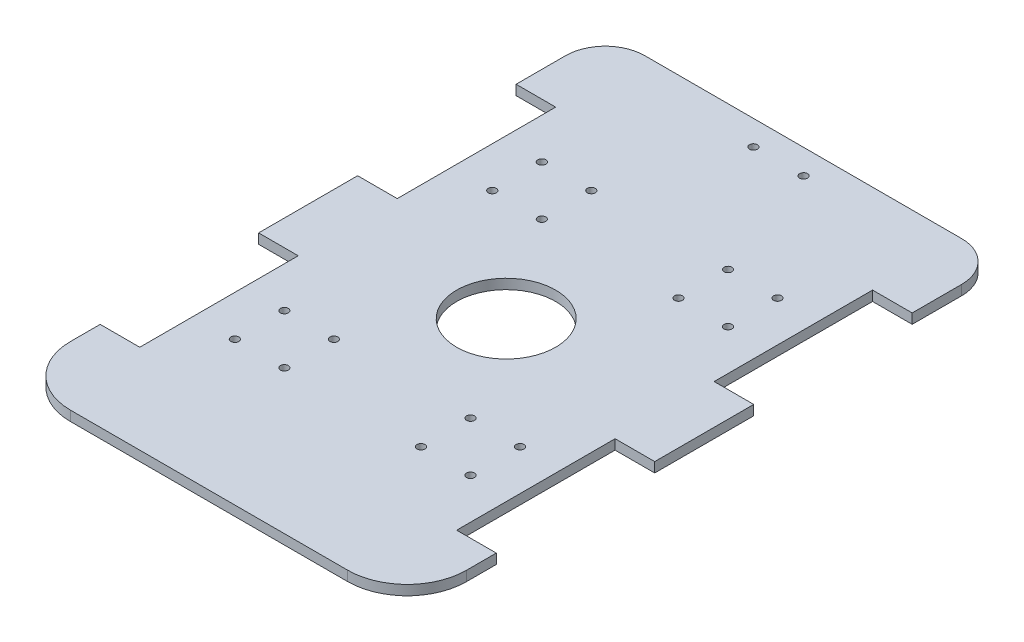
from build123d import *

# Parameters (mm, degrees)
SKETCH1_R           = 25
SKETCH1_R_2         = 2
BOSS_EXTRUDE1_DEPTH = 5


with BuildPart() as part:
    # Sketch1 → Boss-Extrude1 (new body)
    with BuildSketch(Plane(origin=(0, 0, 0), x_dir=(1, 0, 0), z_dir=(0, 1, 0))):
        with BuildLine():
            Line((-80, 150), (80, 150))
            ThreePointArc((80, 150), (94.142135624, 144.142135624), (100, 130))
            Line((100, 130), (100, 105))
            Line((100, 105), (80, 105))
            Line((80, 105), (80, 25))
            Line((80, 25), (100, 25))
            Line((100, 25), (100, -25))
            Line((100, -25), (80, -25))
            Line((80, -25), (80, -105))
            Line((80, -105), (100, -105))
            Line((100, -105), (100, -120))
            ThreePointArc((100, -120), (91.213203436, -141.213203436), (70, -150))
            Line((70, -150), (-70, -150))
            ThreePointArc((-70, -150), (-91.213203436, -141.213203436), (-100, -120))
            Line((-100, -120), (-100, -105))
            Line((-100, -105), (-80, -105))
            Line((-80, -105), (-80, -25))
            Line((-80, -25), (-100, -25))
            Line((-100, -25), (-100, 25))
            Line((-100, 25), (-80, 25))
            Line((-80, 25), (-80, 105))
            Line((-80, 105), (-100, 105))
            Line((-100, 105), (-100, 130))
            ThreePointArc((-100, 130), (-94.142135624, 144.142135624), (-80, 150))
        make_face()
        with Locations(Location((0, 0, 0), (0, 0, 270))):
            Circle(SKETCH1_R, mode=Mode.SUBTRACT)
        with Locations(Location((-34.5, 52.5, 0), (0, 0, 270))):
            Circle(SKETCH1_R_2, mode=Mode.SUBTRACT)
        with Locations(Location((-59.5, 52.5, 0), (0, 0, 270))):
            Circle(SKETCH1_R_2, mode=Mode.SUBTRACT)
        with Locations(Location((-59.5, 77.5, 0), (0, 0, 270))):
            Circle(SKETCH1_R_2, mode=Mode.SUBTRACT)
        with Locations(Location((-34.5, 77.5, 0), (0, 0, 270))):
            Circle(SKETCH1_R_2, mode=Mode.SUBTRACT)
        with Locations(Location((-59.5, -77.5, 0), (0, 0, 90))):
            Circle(SKETCH1_R_2, mode=Mode.SUBTRACT)
        with Locations(Location((-59.5, -52.5, 0), (0, 0, 90))):
            Circle(SKETCH1_R_2, mode=Mode.SUBTRACT)
        with Locations(Location((-34.5, -52.5, 0), (0, 0, 90))):
            Circle(SKETCH1_R_2, mode=Mode.SUBTRACT)
        with Locations(Location((-34.5, -77.5, 0), (0, 0, 90))):
            Circle(SKETCH1_R_2, mode=Mode.SUBTRACT)
        with Locations(Location((59.5, 77.5, 0), (0, 0, 90))):
            Circle(SKETCH1_R_2, mode=Mode.SUBTRACT)
        with Locations(Location((59.5, 52.5, 0), (0, 0, 90))):
            Circle(SKETCH1_R_2, mode=Mode.SUBTRACT)
        with Locations(Location((34.5, 77.5, 0), (0, 0, 90))):
            Circle(SKETCH1_R_2, mode=Mode.SUBTRACT)
        with Locations(Location((34.5, 52.5, 0), (0, 0, 90))):
            Circle(SKETCH1_R_2, mode=Mode.SUBTRACT)
        with Locations(Location((59.5, -52.5, 0), (0, 0, 270))):
            Circle(SKETCH1_R_2, mode=Mode.SUBTRACT)
        with Locations(Location((59.5, -77.5, 0), (0, 0, 270))):
            Circle(SKETCH1_R_2, mode=Mode.SUBTRACT)
        with Locations(Location((34.5, -52.5, 0), (0, 0, 270))):
            Circle(SKETCH1_R_2, mode=Mode.SUBTRACT)
        with Locations(Location((34.5, -77.5, 0), (0, 0, 270))):
            Circle(SKETCH1_R_2, mode=Mode.SUBTRACT)
        with Locations(Location((12.656835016, 137.497440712, 0), (0, 0, 270))):
            Circle(SKETCH1_R_2, mode=Mode.SUBTRACT)
        with Locations(Location((-12.656835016, 137.497440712, 0), (0, 0, 270))):
            Circle(SKETCH1_R_2, mode=Mode.SUBTRACT)
    extrude(amount=BOSS_EXTRUDE1_DEPTH)


solid = part.part
